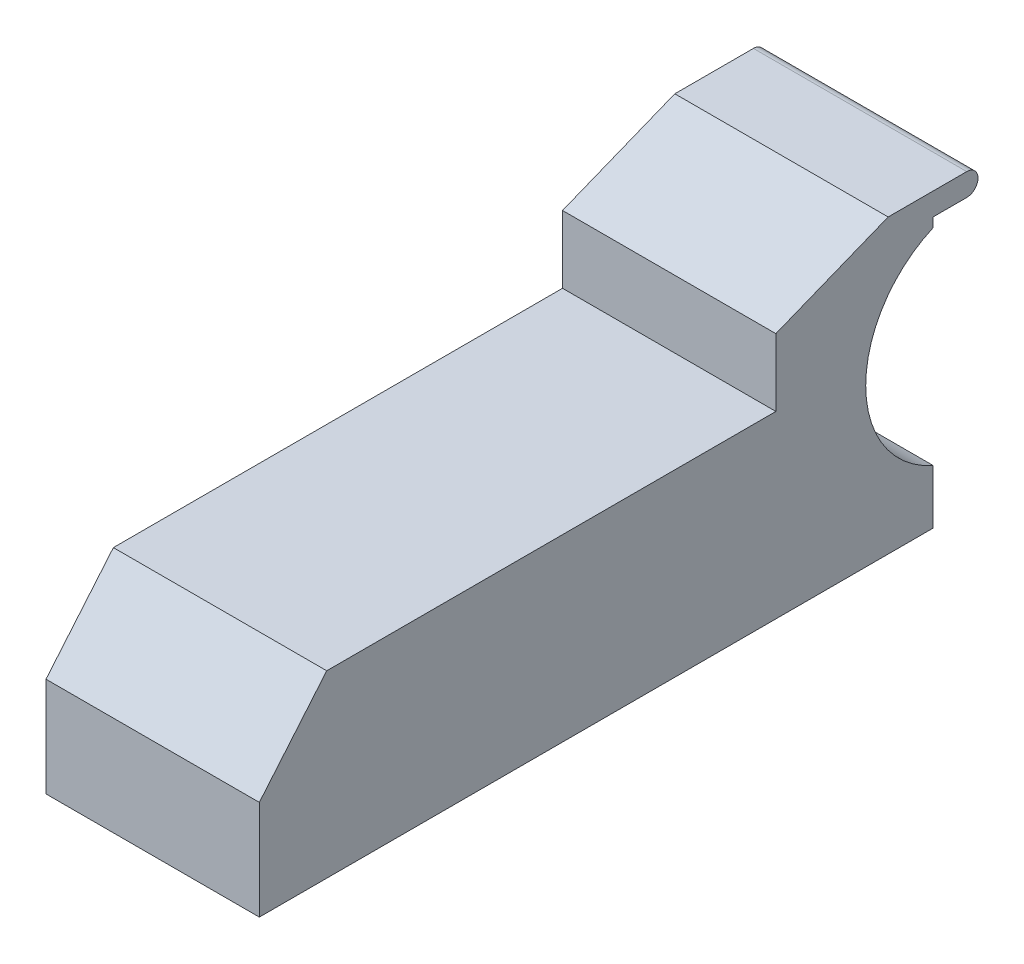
from build123d import *

# Parameters (mm, degrees)
SKETCH_1_W          = 9.5
SKETCH_1_H          = 13
EXTRUDE_1_DEPTH     = 32
SKETCH_2_OUTSIDE_W  = 41.164
SKETCH_2_OUTSIDE_H  = 22.164
CUT_EXTRUDE_1_DEPTH = 32
CUT_EXTRUDE_2_DEPTH = 4


with BuildPart() as part:
    # Sketch 1 → Extrude 1 (new body)
    with BuildSketch(Plane.XY):
        with Locations((4.75, 6.5)):
            Rectangle(SKETCH_1_W, SKETCH_1_H)
    extrude(amount=EXTRUDE_1_DEPTH)

    # Sketch 2 outside → Cut-Extrude 1 (cut)
    with BuildSketch(Plane(origin=(9.5, 0, 0), x_dir=(0, 0, -1), z_dir=(1, 0, 0))):
        with Locations((-16, 6.5)):
            Rectangle(SKETCH_2_OUTSIDE_W, SKETCH_2_OUTSIDE_H)
        with BuildLine():
            Line((-2, 12), (-0.5, 12))
            ThreePointArc((-0.5, 12), (0, 12.5), (-0.5, 13))
            Line((-0.5, 13), (-4, 13))
            Line((-4, 13), (-9, 11))
            Line((-9, 11), (-9, 8))
            Line((-9, 8), (-29, 8))
            Line((-29, 8), (-32, 4.424739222))
            Line((-32, 4.424739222), (-32, 0))
            Line((-32, 0), (-2, 0))
            Line((-2, 0), (-2, 2.417424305))
            ThreePointArc((-2, 2.417424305), (-5, 7), (-2, 11.582575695))
            Line((-2, 11.582575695), (-2, 12))
        make_face(mode=Mode.SUBTRACT)
    extrude(amount=-CUT_EXTRUDE_1_DEPTH, mode=Mode.SUBTRACT)

    # Sketch 4 → Cut-Extrude 2 (cut)
    with BuildSketch(Plane.XZ):
        with BuildLine():
            Line((6.760782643, 26.5), (6.760782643, 10.5))
            ThreePointArc((6.760782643, 10.5), (4.75, 8.489217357), (2.739217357, 10.5))
            Line((2.739217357, 10.5), (2.739217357, 26.5))
            ThreePointArc((2.739217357, 26.5), (4.75, 28.510782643), (6.760782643, 26.5))
        make_face()
    extrude(amount=-CUT_EXTRUDE_2_DEPTH, mode=Mode.SUBTRACT)


solid = part.part
